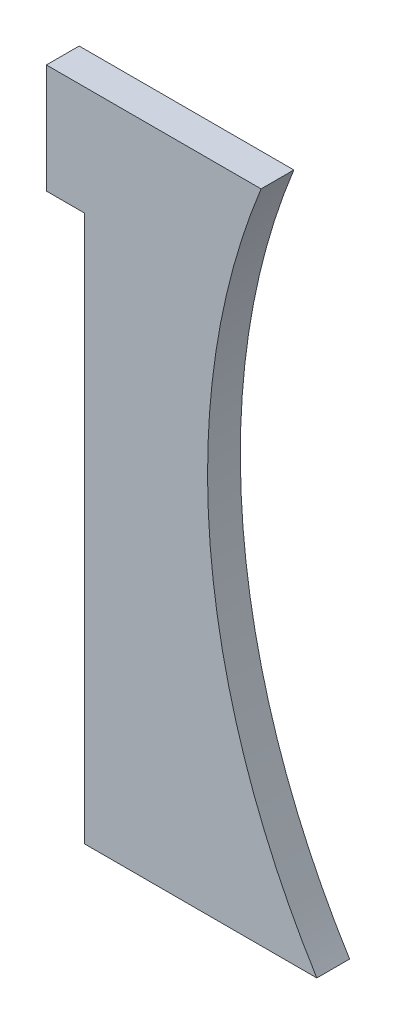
from build123d import *

# Parameters (mm, degrees)
EXTRUSION1_DEPTH = 12


with BuildPart() as part:
    # Esquisse1 → Extrusion1 (new body)
    with BuildSketch(Plane.XY):
        with BuildLine():
            Line((-225, -140), (-310, -140))
            Line((-310, -140), (-310, 60))
            Line((-310, 60), (-324, 60))
            Line((-324, 60), (-324, 100))
            Line((-324, 100), (-245.407823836, 100))
            ThreePointArc((-245.407823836, 100), (-264.047117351, -22.452612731), (-225, -140))
        make_face()
    extrude(amount=EXTRUSION1_DEPTH)


solid = part.part
